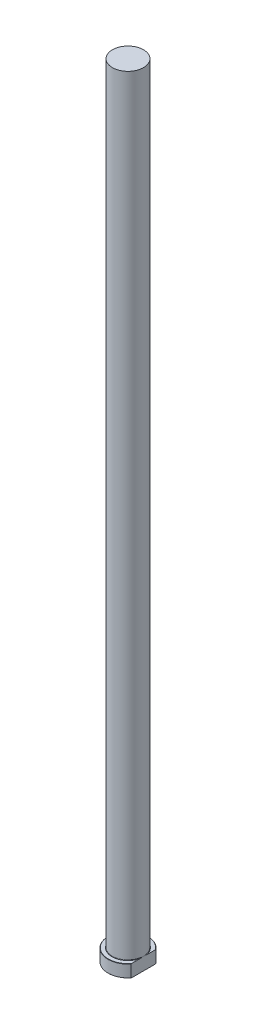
from build123d import *
from build123d.topology import SkipClean

# Parameters (mm, degrees)
CHAMFER1_SIZE = 0.2
FILLET1_R     = 0.3
KEY_DEPTH     = 631.406218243


with BuildPart() as part:
    # Sketch1 → Revolve1 (revolve)
    with BuildSketch(Plane.XY, mode=Mode.PRIVATE) as revolve1_sk:
        Polygon((0, 0), (-16, 0), (-16, 10), (-12.5, 10), (-12.5, 630), (0, 630), align=None)
    revolve(revolve1_sk.sketch.rotate(Axis((0, 259.958771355, 0), (0, -1, 0)), 270), axis=Axis((0, 259.958771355, 0), (0, -1, 0)))

    # Chamfer1
    chamfer1_edges = [part.edges().sort_by_distance(p)[0] for p in [
        (0, 10, -16),
        (0, 0, -16),
    ]]
    chamfer(chamfer1_edges, length=CHAMFER1_SIZE)

    # Fillet1
    fillet1_edges = [part.edges().sort_by_distance(p)[0] for p in [
        (0, 10, -12.5),
    ]]
    fillet(fillet1_edges, radius=FILLET1_R)

    # Sketch2 → KEY (cut, through all)
    with SkipClean():  # the faces are left unmerged after this step: merging them gives an invalid solid
        with BuildSketch(Plane(origin=(0, 0, 0), x_dir=(1, 0, 0), z_dir=(0, 1, 0))):
            with BuildLine():
                Line((12.5, 9.987492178), (12.5, -9.987492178))
                ThreePointArc((12.5, -9.987492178), (16, 0), (12.5, 9.987492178))
            make_face()
        extrude(amount=KEY_DEPTH, mode=Mode.SUBTRACT)


solid = part.part
